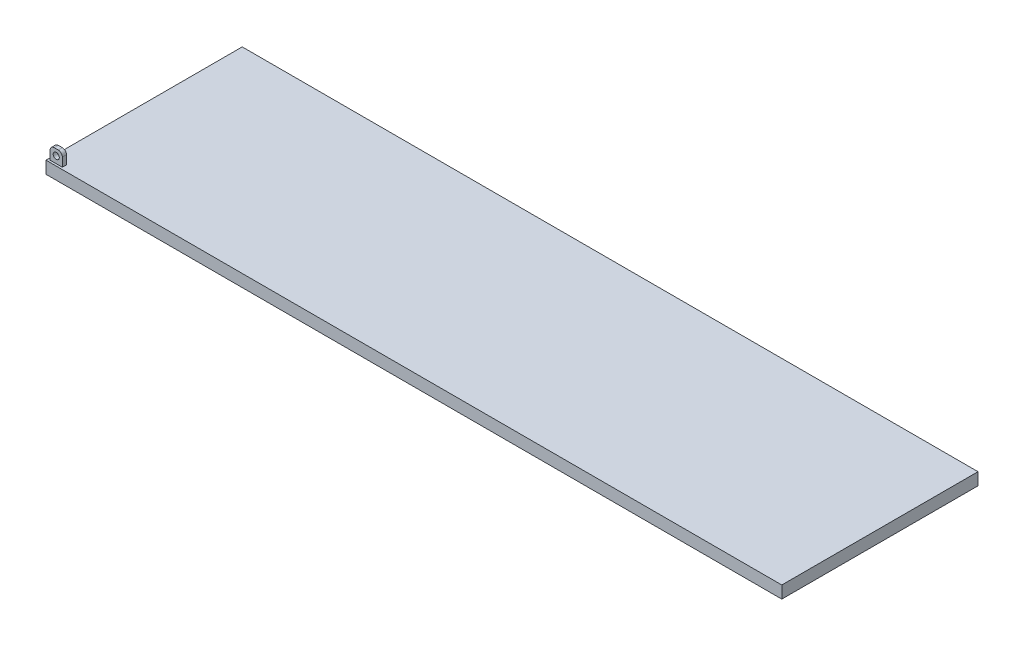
ISO-10303-21;
HEADER;
FILE_DESCRIPTION(('STEP AP214'),'2;1');
FILE_NAME('part.step','',(''),(''),'','','');
FILE_SCHEMA(('AUTOMOTIVE_DESIGN { 1 0 10303 214 1 1 1 1 }'));
ENDSEC;
DATA;
#1=APPLICATION_CONTEXT('core data for automotive mechanical design processes');
#2=APPLICATION_PROTOCOL_DEFINITION('international standard','automotive_design',2000,#1);
#3=PRODUCT_CONTEXT('',#1,'mechanical');
#4=PRODUCT('Part','Part','',(#3));
#5=PRODUCT_RELATED_PRODUCT_CATEGORY('part','',(#4));
#6=PRODUCT_DEFINITION_FORMATION('','',#4);
#7=PRODUCT_DEFINITION_CONTEXT('part definition',#1,'design');
#8=PRODUCT_DEFINITION('design','',#6,#7);
#9=PRODUCT_DEFINITION_SHAPE('','',#8);
#10=(LENGTH_UNIT() NAMED_UNIT(*) SI_UNIT(.MILLI.,.METRE.));
#11=(NAMED_UNIT(*) PLANE_ANGLE_UNIT() SI_UNIT($,.RADIAN.));
#12=(NAMED_UNIT(*) SI_UNIT($,.STERADIAN.) SOLID_ANGLE_UNIT());
#13=UNCERTAINTY_MEASURE_WITH_UNIT(LENGTH_MEASURE(1.E-05),#10,'distance_accuracy_value','');
#14=(GEOMETRIC_REPRESENTATION_CONTEXT(3) GLOBAL_UNCERTAINTY_ASSIGNED_CONTEXT((#13)) GLOBAL_UNIT_ASSIGNED_CONTEXT((#10,
#11,#12)) REPRESENTATION_CONTEXT('',''));
#15=CARTESIAN_POINT('',(0.,0.,0.));
#16=DIRECTION('',(0.,0.,1.));
#17=DIRECTION('',(1.,0.,0.));
#18=AXIS2_PLACEMENT_3D('',#15,#16,#17);
#19=CARTESIAN_POINT('',(4572.,152.4,1219.2));
#20=DIRECTION('',(0.,1.,0.));
#21=DIRECTION('',(0.,0.,1.));
#22=AXIS2_PLACEMENT_3D('',#19,#20,#21);
#23=PLANE('',#22);
#24=DIRECTION('',(0.,0.,-1.));
#25=VECTOR('',#24,1.);
#26=CARTESIAN_POINT('',(4572.,152.4,-1219.2));
#27=LINE('',#26,#25);
#28=CARTESIAN_POINT('',(4572.,152.4,1219.2));
#29=VERTEX_POINT('',#28);
#30=CARTESIAN_POINT('',(4572.,152.4,-1219.2));
#31=VERTEX_POINT('',#30);
#32=EDGE_CURVE('E147',#29,#31,#27,.T.);
#33=ORIENTED_EDGE('',*,*,#32,.T.);
#34=DIRECTION('',(-1.,0.,0.));
#35=VECTOR('',#34,1.);
#36=CARTESIAN_POINT('',(-4572.,152.4,-1219.2));
#37=LINE('',#36,#35);
#38=CARTESIAN_POINT('',(-4572.,152.4,-1219.2));
#39=VERTEX_POINT('',#38);
#40=EDGE_CURVE('E150',#31,#39,#37,.T.);
#41=ORIENTED_EDGE('',*,*,#40,.T.);
#42=DIRECTION('',(0.,0.,1.));
#43=VECTOR('',#42,1.);
#44=CARTESIAN_POINT('',(-4572.,152.4,-1219.2));
#45=LINE('',#44,#43);
#46=CARTESIAN_POINT('',(-4572.,152.4,1219.2));
#47=VERTEX_POINT('',#46);
#48=EDGE_CURVE('E153',#39,#47,#45,.T.);
#49=ORIENTED_EDGE('',*,*,#48,.T.);
#50=DIRECTION('',(1.,0.,0.));
#51=VECTOR('',#50,1.);
#52=CARTESIAN_POINT('',(-4572.,152.4,1219.2));
#53=LINE('',#52,#51);
#54=EDGE_CURVE('E155',#47,#29,#53,.T.);
#55=ORIENTED_EDGE('',*,*,#54,.T.);
#56=EDGE_LOOP('',(#33,#41,#49,#55));
#57=FACE_BOUND('',#56,.T.);
#58=DIRECTION('',(-1.,0.,0.));
#59=VECTOR('',#58,1.);
#60=CARTESIAN_POINT('',(-4546.6,152.4,1143.));
#61=LINE('',#60,#59);
#62=CARTESIAN_POINT('',(-4394.2,152.4,1143.));
#63=VERTEX_POINT('',#62);
#64=CARTESIAN_POINT('',(-4546.6,152.4,1143.));
#65=VERTEX_POINT('',#64);
#66=EDGE_CURVE('E118',#63,#65,#61,.T.);
#67=ORIENTED_EDGE('',*,*,#66,.F.);
#68=DIRECTION('',(0.,0.,-1.));
#69=VECTOR('',#68,1.);
#70=CARTESIAN_POINT('',(-4394.2,152.4,1143.));
#71=LINE('',#70,#69);
#72=CARTESIAN_POINT('',(-4394.2,152.4,1193.8));
#73=VERTEX_POINT('',#72);
#74=EDGE_CURVE('E125',#73,#63,#71,.T.);
#75=ORIENTED_EDGE('',*,*,#74,.F.);
#76=DIRECTION('',(1.,0.,0.));
#77=VECTOR('',#76,1.);
#78=CARTESIAN_POINT('',(-4546.6,152.4,1193.8));
#79=LINE('',#78,#77);
#80=CARTESIAN_POINT('',(-4546.6,152.4,1193.8));
#81=VERTEX_POINT('',#80);
#82=EDGE_CURVE('E136',#81,#73,#79,.T.);
#83=ORIENTED_EDGE('',*,*,#82,.F.);
#84=DIRECTION('',(0.,0.,1.));
#85=VECTOR('',#84,1.);
#86=CARTESIAN_POINT('',(-4546.6,152.4,1143.));
#87=LINE('',#86,#85);
#88=EDGE_CURVE('E134',#65,#81,#87,.T.);
#89=ORIENTED_EDGE('',*,*,#88,.F.);
#90=EDGE_LOOP('',(#67,#75,#83,#89));
#91=FACE_BOUND('',#90,.T.);
#92=ADVANCED_FACE('F36',(#57,#91),#23,.T.);
#93=CARTESIAN_POINT('',(4572.,152.4,-1219.2));
#94=DIRECTION('',(-1.,0.,0.));
#95=DIRECTION('',(0.,0.,1.));
#96=AXIS2_PLACEMENT_3D('',#93,#94,#95);
#97=PLANE('',#96);
#98=DIRECTION('',(0.,0.,-1.));
#99=VECTOR('',#98,1.);
#100=CARTESIAN_POINT('',(4572.,0.,-1219.2));
#101=LINE('',#100,#99);
#102=CARTESIAN_POINT('',(4572.,0.,1219.2));
#103=VERTEX_POINT('',#102);
#104=CARTESIAN_POINT('',(4572.,0.,-1219.2));
#105=VERTEX_POINT('',#104);
#106=EDGE_CURVE('E121',#103,#105,#101,.T.);
#107=ORIENTED_EDGE('',*,*,#106,.T.);
#108=DIRECTION('',(0.,-1.,0.));
#109=VECTOR('',#108,1.);
#110=CARTESIAN_POINT('',(4572.,152.4,-1219.2));
#111=LINE('',#110,#109);
#112=EDGE_CURVE('E173',#31,#105,#111,.T.);
#113=ORIENTED_EDGE('',*,*,#112,.F.);
#114=ORIENTED_EDGE('',*,*,#32,.F.);
#115=DIRECTION('',(0.,-1.,0.));
#116=VECTOR('',#115,1.);
#117=CARTESIAN_POINT('',(4572.,152.4,1219.2));
#118=LINE('',#117,#116);
#119=EDGE_CURVE('E157',#29,#103,#118,.T.);
#120=ORIENTED_EDGE('',*,*,#119,.T.);
#121=EDGE_LOOP('',(#107,#113,#114,#120));
#122=FACE_BOUND('',#121,.T.);
#123=ADVANCED_FACE('F206',(#122),#97,.F.);
#124=CARTESIAN_POINT('',(-4572.,152.4,-1219.2));
#125=DIRECTION('',(0.,0.,1.));
#126=DIRECTION('',(1.,0.,0.));
#127=AXIS2_PLACEMENT_3D('',#124,#125,#126);
#128=PLANE('',#127);
#129=DIRECTION('',(-1.,0.,0.));
#130=VECTOR('',#129,1.);
#131=CARTESIAN_POINT('',(-4572.,0.,-1219.2));
#132=LINE('',#131,#130);
#133=CARTESIAN_POINT('',(-4572.,0.,-1219.2));
#134=VERTEX_POINT('',#133);
#135=EDGE_CURVE('E160',#105,#134,#132,.T.);
#136=ORIENTED_EDGE('',*,*,#135,.T.);
#137=DIRECTION('',(0.,-1.,0.));
#138=VECTOR('',#137,1.);
#139=CARTESIAN_POINT('',(-4572.,152.4,-1219.2));
#140=LINE('',#139,#138);
#141=EDGE_CURVE('E170',#39,#134,#140,.T.);
#142=ORIENTED_EDGE('',*,*,#141,.F.);
#143=ORIENTED_EDGE('',*,*,#40,.F.);
#144=ORIENTED_EDGE('',*,*,#112,.T.);
#145=EDGE_LOOP('',(#136,#142,#143,#144));
#146=FACE_BOUND('',#145,.T.);
#147=ADVANCED_FACE('F212',(#146),#128,.F.);
#148=CARTESIAN_POINT('',(-4572.,152.4,-1219.2));
#149=DIRECTION('',(1.,0.,0.));
#150=DIRECTION('',(0.,0.,-1.));
#151=AXIS2_PLACEMENT_3D('',#148,#149,#150);
#152=PLANE('',#151);
#153=DIRECTION('',(0.,0.,1.));
#154=VECTOR('',#153,1.);
#155=CARTESIAN_POINT('',(-4572.,0.,-1219.2));
#156=LINE('',#155,#154);
#157=CARTESIAN_POINT('',(-4572.,0.,1219.2));
#158=VERTEX_POINT('',#157);
#159=EDGE_CURVE('E162',#134,#158,#156,.T.);
#160=ORIENTED_EDGE('',*,*,#159,.T.);
#161=DIRECTION('',(0.,-1.,0.));
#162=VECTOR('',#161,1.);
#163=CARTESIAN_POINT('',(-4572.,152.4,1219.2));
#164=LINE('',#163,#162);
#165=EDGE_CURVE('E167',#47,#158,#164,.T.);
#166=ORIENTED_EDGE('',*,*,#165,.F.);
#167=ORIENTED_EDGE('',*,*,#48,.F.);
#168=ORIENTED_EDGE('',*,*,#141,.T.);
#169=EDGE_LOOP('',(#160,#166,#167,#168));
#170=FACE_BOUND('',#169,.T.);
#171=ADVANCED_FACE('F224',(#170),#152,.F.);
#172=CARTESIAN_POINT('',(-4572.,152.4,1219.2));
#173=DIRECTION('',(0.,0.,-1.));
#174=DIRECTION('',(-1.,0.,0.));
#175=AXIS2_PLACEMENT_3D('',#172,#173,#174);
#176=PLANE('',#175);
#177=DIRECTION('',(1.,0.,0.));
#178=VECTOR('',#177,1.);
#179=CARTESIAN_POINT('',(-4572.,0.,1219.2));
#180=LINE('',#179,#178);
#181=EDGE_CURVE('E151',#158,#103,#180,.T.);
#182=ORIENTED_EDGE('',*,*,#181,.T.);
#183=ORIENTED_EDGE('',*,*,#119,.F.);
#184=ORIENTED_EDGE('',*,*,#54,.F.);
#185=ORIENTED_EDGE('',*,*,#165,.T.);
#186=EDGE_LOOP('',(#182,#183,#184,#185));
#187=FACE_BOUND('',#186,.T.);
#188=ADVANCED_FACE('F220',(#187),#176,.F.);
#189=CARTESIAN_POINT('',(4572.,0.,1219.2));
#190=DIRECTION('',(0.,1.,0.));
#191=DIRECTION('',(0.,0.,1.));
#192=AXIS2_PLACEMENT_3D('',#189,#190,#191);
#193=PLANE('',#192);
#194=ORIENTED_EDGE('',*,*,#106,.F.);
#195=ORIENTED_EDGE('',*,*,#181,.F.);
#196=ORIENTED_EDGE('',*,*,#159,.F.);
#197=ORIENTED_EDGE('',*,*,#135,.F.);
#198=EDGE_LOOP('',(#194,#195,#196,#197));
#199=FACE_BOUND('',#198,.T.);
#200=ADVANCED_FACE('F217',(#199),#193,.F.);
#201=CARTESIAN_POINT('',(-4394.2,312.266518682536,1143.));
#202=DIRECTION('',(-1.,0.,0.));
#203=DIRECTION('',(0.,0.,1.));
#204=AXIS2_PLACEMENT_3D('',#201,#202,#203);
#205=PLANE('',#204);
#206=DIRECTION('',(0.,-1.,0.));
#207=VECTOR('',#206,1.);
#208=CARTESIAN_POINT('',(-4394.2,312.266518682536,1143.));
#209=LINE('',#208,#207);
#210=CARTESIAN_POINT('',(-4394.2,261.466518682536,1143.));
#211=VERTEX_POINT('',#210);
#212=EDGE_CURVE('E112',#211,#63,#209,.T.);
#213=ORIENTED_EDGE('',*,*,#212,.F.);
#214=DIRECTION('',(0.,0.,-1.));
#215=VECTOR('',#214,1.);
#216=CARTESIAN_POINT('',(-4394.2,261.466518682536,1193.8));
#217=LINE('',#216,#215);
#218=CARTESIAN_POINT('',(-4394.2,261.466518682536,1193.8));
#219=VERTEX_POINT('',#218);
#220=EDGE_CURVE('E59',#211,#219,#217,.F.);
#221=ORIENTED_EDGE('',*,*,#220,.T.);
#222=DIRECTION('',(0.,-1.,0.));
#223=VECTOR('',#222,1.);
#224=CARTESIAN_POINT('',(-4394.2,312.266518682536,1193.8));
#225=LINE('',#224,#223);
#226=EDGE_CURVE('E127',#219,#73,#225,.T.);
#227=ORIENTED_EDGE('',*,*,#226,.T.);
#228=ORIENTED_EDGE('',*,*,#74,.T.);
#229=EDGE_LOOP('',(#213,#221,#227,#228));
#230=FACE_BOUND('',#229,.T.);
#231=ADVANCED_FACE('F126',(#230),#205,.F.);
#232=CARTESIAN_POINT('',(-4546.6,312.266518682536,1143.));
#233=DIRECTION('',(0.,0.,1.));
#234=DIRECTION('',(1.,0.,0.));
#235=AXIS2_PLACEMENT_3D('',#232,#233,#234);
#236=PLANE('',#235);
#237=CARTESIAN_POINT('',(-4470.4,237.180741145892,1143.));
#238=DIRECTION('',(0.,0.,1.));
#239=DIRECTION('',(1.,0.,0.));
#240=AXIS2_PLACEMENT_3D('',#237,#238,#239);
#241=CIRCLE('',#240,38.1000000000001);
#242=CARTESIAN_POINT('',(-4432.3,237.180741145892,1143.));
#243=VERTEX_POINT('',#242);
#244=EDGE_CURVE('E131',#243,#243,#241,.F.);
#245=ORIENTED_EDGE('',*,*,#244,.F.);
#246=EDGE_LOOP('',(#245));
#247=FACE_BOUND('',#246,.T.);
#248=DIRECTION('',(-1.,0.,0.));
#249=VECTOR('',#248,1.);
#250=CARTESIAN_POINT('',(-4546.6,312.266518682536,1143.));
#251=LINE('',#250,#249);
#252=CARTESIAN_POINT('',(-4445.,312.266518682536,1143.));
#253=VERTEX_POINT('',#252);
#254=CARTESIAN_POINT('',(-4495.8,312.266518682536,1143.));
#255=VERTEX_POINT('',#254);
#256=EDGE_CURVE('E141',#253,#255,#251,.T.);
#257=ORIENTED_EDGE('',*,*,#256,.F.);
#258=CARTESIAN_POINT('',(-4445.,261.466518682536,1143.));
#259=DIRECTION('',(0.,0.,1.));
#260=DIRECTION('',(1.,0.,0.));
#261=AXIS2_PLACEMENT_3D('',#258,#259,#260);
#262=CIRCLE('',#261,50.8);
#263=EDGE_CURVE('E120',#253,#211,#262,.F.);
#264=ORIENTED_EDGE('',*,*,#263,.T.);
#265=ORIENTED_EDGE('',*,*,#212,.T.);
#266=ORIENTED_EDGE('',*,*,#66,.T.);
#267=DIRECTION('',(0.,-1.,0.));
#268=VECTOR('',#267,1.);
#269=CARTESIAN_POINT('',(-4546.6,312.266518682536,1143.));
#270=LINE('',#269,#268);
#271=CARTESIAN_POINT('',(-4546.6,261.466518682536,1143.));
#272=VERTEX_POINT('',#271);
#273=EDGE_CURVE('E122',#272,#65,#270,.T.);
#274=ORIENTED_EDGE('',*,*,#273,.F.);
#275=CARTESIAN_POINT('',(-4495.8,261.466518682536,1143.));
#276=DIRECTION('',(0.,0.,1.));
#277=DIRECTION('',(1.,0.,0.));
#278=AXIS2_PLACEMENT_3D('',#275,#276,#277);
#279=CIRCLE('',#278,50.8);
#280=EDGE_CURVE('E182',#272,#255,#279,.F.);
#281=ORIENTED_EDGE('',*,*,#280,.T.);
#282=EDGE_LOOP('',(#257,#264,#265,#266,#274,#281));
#283=FACE_BOUND('',#282,.T.);
#284=ADVANCED_FACE('F115',(#247,#283),#236,.F.);
#285=CARTESIAN_POINT('',(-4546.6,312.266518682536,1143.));
#286=DIRECTION('',(1.,0.,0.));
#287=DIRECTION('',(0.,0.,-1.));
#288=AXIS2_PLACEMENT_3D('',#285,#286,#287);
#289=PLANE('',#288);
#290=DIRECTION('',(0.,-1.,0.));
#291=VECTOR('',#290,1.);
#292=CARTESIAN_POINT('',(-4546.6,312.266518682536,1193.8));
#293=LINE('',#292,#291);
#294=CARTESIAN_POINT('',(-4546.6,261.466518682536,1193.8));
#295=VERTEX_POINT('',#294);
#296=EDGE_CURVE('E143',#295,#81,#293,.T.);
#297=ORIENTED_EDGE('',*,*,#296,.F.);
#298=DIRECTION('',(0.,0.,1.));
#299=VECTOR('',#298,1.);
#300=CARTESIAN_POINT('',(-4546.6,261.466518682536,1143.));
#301=LINE('',#300,#299);
#302=EDGE_CURVE('E11',#295,#272,#301,.F.);
#303=ORIENTED_EDGE('',*,*,#302,.T.);
#304=ORIENTED_EDGE('',*,*,#273,.T.);
#305=ORIENTED_EDGE('',*,*,#88,.T.);
#306=EDGE_LOOP('',(#297,#303,#304,#305));
#307=FACE_BOUND('',#306,.T.);
#308=ADVANCED_FACE('F269',(#307),#289,.F.);
#309=CARTESIAN_POINT('',(-4546.6,312.266518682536,1193.8));
#310=DIRECTION('',(0.,0.,-1.));
#311=DIRECTION('',(-1.,0.,0.));
#312=AXIS2_PLACEMENT_3D('',#309,#310,#311);
#313=PLANE('',#312);
#314=CARTESIAN_POINT('',(-4470.4,237.180741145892,1193.8));
#315=DIRECTION('',(0.,0.,1.));
#316=DIRECTION('',(1.,0.,0.));
#317=AXIS2_PLACEMENT_3D('',#314,#315,#316);
#318=CIRCLE('',#317,38.1000000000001);
#319=CARTESIAN_POINT('',(-4432.3,237.180741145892,1193.8));
#320=VERTEX_POINT('',#319);
#321=EDGE_CURVE('E313',#320,#320,#318,.T.);
#322=ORIENTED_EDGE('',*,*,#321,.F.);
#323=EDGE_LOOP('',(#322));
#324=FACE_BOUND('',#323,.T.);
#325=ORIENTED_EDGE('',*,*,#226,.F.);
#326=CARTESIAN_POINT('',(-4445.,261.466518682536,1193.8));
#327=DIRECTION('',(0.,0.,-1.));
#328=DIRECTION('',(-1.,0.,0.));
#329=AXIS2_PLACEMENT_3D('',#326,#327,#328);
#330=CIRCLE('',#329,50.8);
#331=CARTESIAN_POINT('',(-4445.,312.266518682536,1193.8));
#332=VERTEX_POINT('',#331);
#333=EDGE_CURVE('E44',#219,#332,#330,.F.);
#334=ORIENTED_EDGE('',*,*,#333,.T.);
#335=DIRECTION('',(1.,0.,0.));
#336=VECTOR('',#335,1.);
#337=CARTESIAN_POINT('',(-4546.6,312.266518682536,1193.8));
#338=LINE('',#337,#336);
#339=CARTESIAN_POINT('',(-4495.8,312.266518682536,1193.8));
#340=VERTEX_POINT('',#339);
#341=EDGE_CURVE('E144',#340,#332,#338,.T.);
#342=ORIENTED_EDGE('',*,*,#341,.F.);
#343=CARTESIAN_POINT('',(-4495.8,261.466518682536,1193.8));
#344=DIRECTION('',(0.,0.,-1.));
#345=DIRECTION('',(-1.,0.,0.));
#346=AXIS2_PLACEMENT_3D('',#343,#344,#345);
#347=CIRCLE('',#346,50.8);
#348=EDGE_CURVE('E51',#340,#295,#347,.F.);
#349=ORIENTED_EDGE('',*,*,#348,.T.);
#350=ORIENTED_EDGE('',*,*,#296,.T.);
#351=ORIENTED_EDGE('',*,*,#82,.T.);
#352=EDGE_LOOP('',(#325,#334,#342,#349,#350,#351));
#353=FACE_BOUND('',#352,.T.);
#354=ADVANCED_FACE('F188',(#324,#353),#313,.F.);
#355=CARTESIAN_POINT('',(-4394.2,312.266518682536,1193.8));
#356=DIRECTION('',(0.,1.,0.));
#357=DIRECTION('',(0.,0.,1.));
#358=AXIS2_PLACEMENT_3D('',#355,#356,#357);
#359=PLANE('',#358);
#360=ORIENTED_EDGE('',*,*,#341,.T.);
#361=DIRECTION('',(0.,0.,-1.));
#362=VECTOR('',#361,1.);
#363=CARTESIAN_POINT('',(-4445.,312.266518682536,1143.));
#364=LINE('',#363,#362);
#365=EDGE_CURVE('E179',#332,#253,#364,.T.);
#366=ORIENTED_EDGE('',*,*,#365,.T.);
#367=ORIENTED_EDGE('',*,*,#256,.T.);
#368=DIRECTION('',(0.,0.,1.));
#369=VECTOR('',#368,1.);
#370=CARTESIAN_POINT('',(-4495.8,312.266518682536,1193.8));
#371=LINE('',#370,#369);
#372=EDGE_CURVE('E176',#255,#340,#371,.T.);
#373=ORIENTED_EDGE('',*,*,#372,.T.);
#374=EDGE_LOOP('',(#360,#366,#367,#373));
#375=FACE_BOUND('',#374,.T.);
#376=ADVANCED_FACE('F192',(#375),#359,.T.);
#377=CARTESIAN_POINT('',(-4445.,261.466518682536,1193.8));
#378=DIRECTION('',(0.,0.,1.));
#379=DIRECTION('',(1.,0.,0.));
#380=AXIS2_PLACEMENT_3D('',#377,#378,#379);
#381=CYLINDRICAL_SURFACE('',#380,50.8);
#382=ORIENTED_EDGE('',*,*,#333,.F.);
#383=ORIENTED_EDGE('',*,*,#220,.F.);
#384=ORIENTED_EDGE('',*,*,#263,.F.);
#385=ORIENTED_EDGE('',*,*,#365,.F.);
#386=EDGE_LOOP('',(#382,#383,#384,#385));
#387=FACE_BOUND('',#386,.T.);
#388=ADVANCED_FACE('F195',(#387),#381,.T.);
#389=CARTESIAN_POINT('',(-4495.8,261.466518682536,1193.8));
#390=DIRECTION('',(0.,0.,-1.));
#391=DIRECTION('',(-1.,0.,0.));
#392=AXIS2_PLACEMENT_3D('',#389,#390,#391);
#393=CYLINDRICAL_SURFACE('',#392,50.8);
#394=ORIENTED_EDGE('',*,*,#280,.F.);
#395=ORIENTED_EDGE('',*,*,#302,.F.);
#396=ORIENTED_EDGE('',*,*,#348,.F.);
#397=ORIENTED_EDGE('',*,*,#372,.F.);
#398=EDGE_LOOP('',(#394,#395,#396,#397));
#399=FACE_BOUND('',#398,.T.);
#400=ADVANCED_FACE('F38',(#399),#393,.T.);
#401=CARTESIAN_POINT('',(-4470.4,237.180741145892,-1219.201));
#402=DIRECTION('',(0.,0.,1.));
#403=DIRECTION('',(1.,0.,0.));
#404=AXIS2_PLACEMENT_3D('',#401,#402,#403);
#405=CYLINDRICAL_SURFACE('',#404,38.1000000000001);
#406=ORIENTED_EDGE('',*,*,#321,.T.);
#407=EDGE_LOOP('',(#406));
#408=FACE_BOUND('',#407,.T.);
#409=ORIENTED_EDGE('',*,*,#244,.T.);
#410=EDGE_LOOP('',(#409));
#411=FACE_BOUND('',#410,.T.);
#412=ADVANCED_FACE('F201',(#408,#411),#405,.F.);
#413=CLOSED_SHELL('',(#92,#123,#147,#171,#188,#200,#231,#284,#308,#354,#376,#388,#400,#412));
#414=MANIFOLD_SOLID_BREP('B2',#413);
#415=ADVANCED_BREP_SHAPE_REPRESENTATION('',(#18,#414),#14);
#416=SHAPE_DEFINITION_REPRESENTATION(#9,#415);
ENDSEC;
END-ISO-10303-21;
